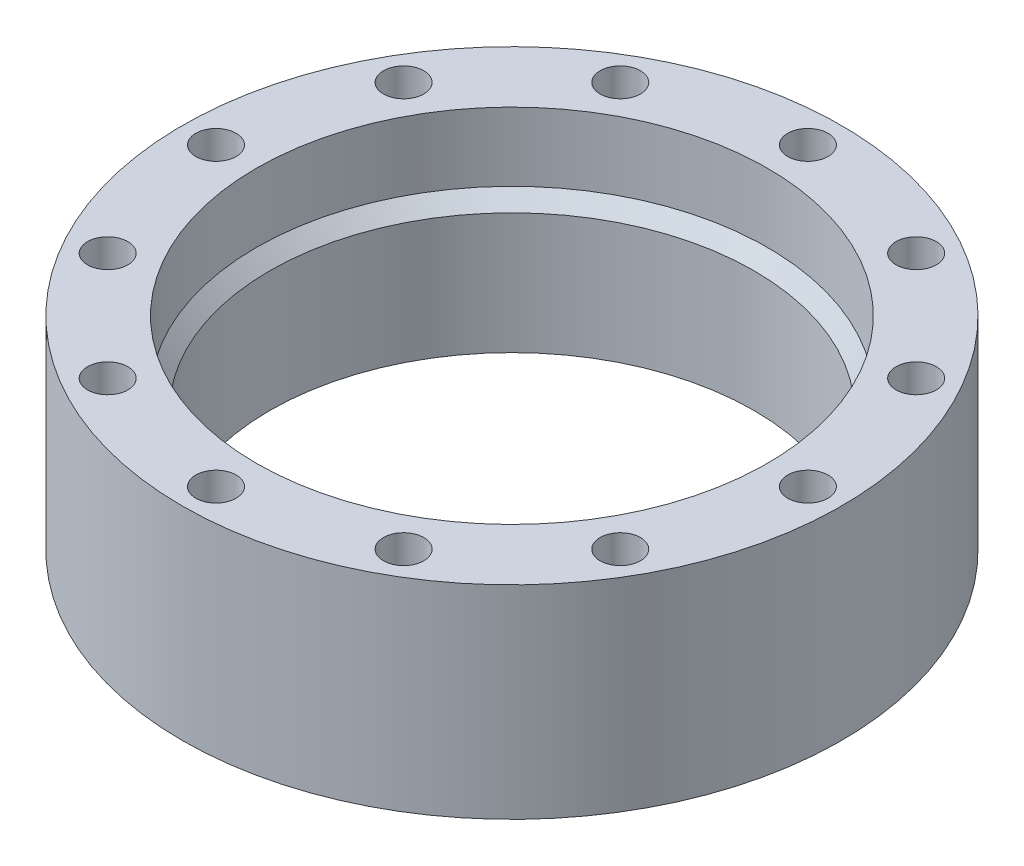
from build123d import *

# Parameters (mm, degrees)
SKETCH1_R           = 24.5
SKETCH1_R_2         = 19
BOSS_EXTRUDE1_DEPTH = 15.1
SKETCH2_R           = 1.5
CUT_EXTRUDE1_DEPTH  = 7


with BuildPart() as part:
    # Sketch1 → Boss-Extrude1 (new body)
    with BuildSketch(Plane(origin=(0, 0, 0), x_dir=(1, 0, 0), z_dir=(0, 1, 0))):
        with Locations(Location((0, 0, 0), (0, 0, 270))):
            Circle(SKETCH1_R)
        with Locations(Location((0, 0, 0), (0, 0, 270))):
            Circle(SKETCH1_R_2, mode=Mode.SUBTRACT)
    extrude(amount=BOSS_EXTRUDE1_DEPTH)

    # Sketch2 → Cut-Extrude1 (cut)
    with BuildSketch(Plane(origin=(0, 15.1, 0), x_dir=(1, 0, 0), z_dir=(0, 1, 0))):
        with Locations(Location((0, 22, 0), (0, 0, 270))):
            Circle(SKETCH2_R)
        with Locations(Location((11, 19.052558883, 0), (0, 0, 270))):
            Circle(SKETCH2_R)
        with Locations(Location((19.052558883, 11, 0), (0, 0, 270))):
            Circle(SKETCH2_R)
        with Locations(Location((22, 0, 0), (0, 0, 270))):
            Circle(SKETCH2_R)
        with Locations(Location((19.052558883, -11, 0), (0, 0, 270))):
            Circle(SKETCH2_R)
        with Locations(Location((11, -19.052558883, 0), (0, 0, 270))):
            Circle(SKETCH2_R)
        with Locations(Location((0, -22, 0), (0, 0, 270))):
            Circle(SKETCH2_R)
        with Locations(Location((-11, -19.052558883, 0), (0, 0, 270))):
            Circle(SKETCH2_R)
        with Locations(Location((-19.052558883, -11, 0), (0, 0, 270))):
            Circle(SKETCH2_R)
        with Locations(Location((-22, 0, 0), (0, 0, 270))):
            Circle(SKETCH2_R)
        with Locations(Location((-19.052558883, 11, 0), (0, 0, 270))):
            Circle(SKETCH2_R)
        with Locations(Location((-11, 19.052558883, 0), (0, 0, 270))):
            Circle(SKETCH2_R)
    extrude(amount=-CUT_EXTRUDE1_DEPTH, mode=Mode.SUBTRACT)

    # Sketch3 → Revolve1 (revolve)
    with BuildSketch(Plane.XY, mode=Mode.PRIVATE) as revolve1_sk:
        Polygon((18, 0), (18, 9), (19, 10), (19, 0), align=None)
    revolve(revolve1_sk.sketch.rotate(Axis((0, 0, 0), (0, 1, 0)), 180), axis=Axis((0, 0, 0), (0, 1, 0)))


solid = part.part
